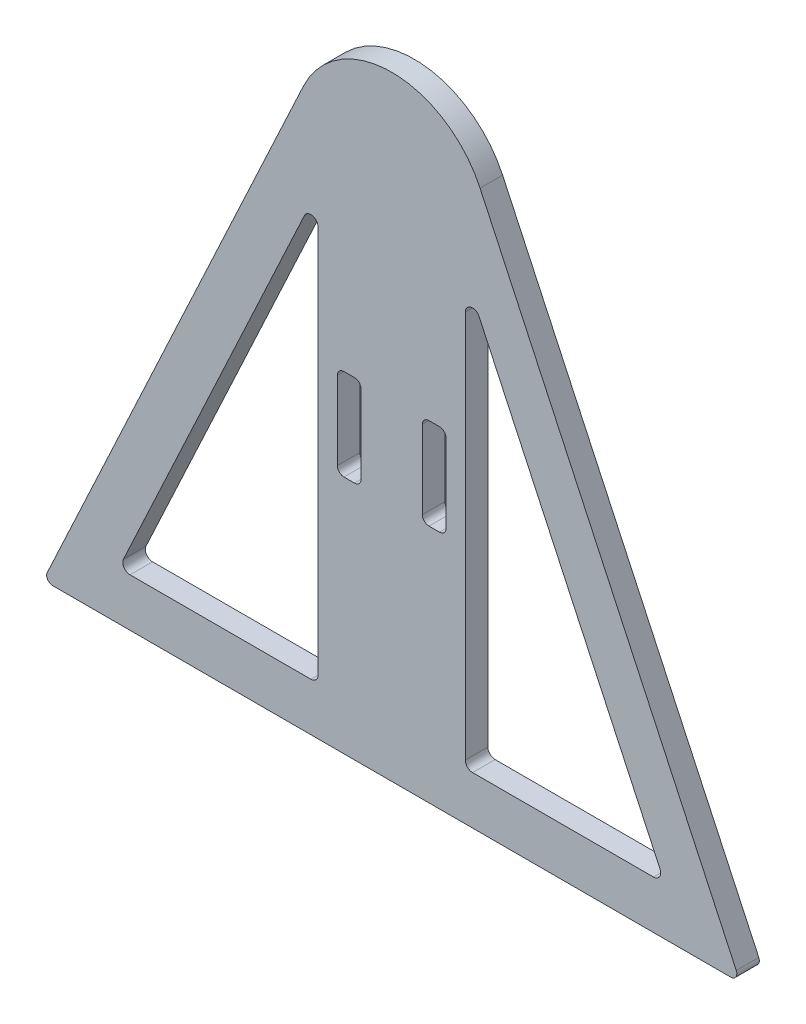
from build123d import *

# Parameters (mm, degrees)
EXTRUDE1_DEPTH     = 4.7625
CUT_EXTRUDE1_DEPTH = 150.337799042
FILLET1_R          = 1.27
CUT_EXTRUDE2_DEPTH = 149.982265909


with BuildPart() as part:
    # Sketch1 → Extrude1 (new body)
    with BuildSketch(Plane.XY):
        with BuildLine():
            Line((73.66, 0), (-73.66, 0))
            Line((-73.66, 0), (-18.670180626, 117.926048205))
            ThreePointArc((-18.670180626, 117.926048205), (0, 129.820265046), (18.670180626, 117.926048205))
            Line((18.670180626, 117.926048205), (73.66, 0))
        make_face()
    extrude(amount=EXTRUDE1_DEPTH)

    # Sketch2 → Cut-Extrude1 (cut, through all)
    with BuildSketch(Plane.XY.offset(4.7625)):
        with BuildLine():
            Line((-11.4935, 52.07), (-11.4935, 68.58))
            ThreePointArc((-11.4935, 68.58), (-11.084328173, 69.567828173), (-10.0965, 69.977))
            Line((-10.0965, 69.977), (-7.874, 69.977))
            ThreePointArc((-7.874, 69.977), (-6.886171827, 69.567828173), (-6.477, 68.58))
            Line((-6.477, 68.58), (-6.477, 52.07))
            ThreePointArc((-6.477, 52.07), (-6.886171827, 51.082171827), (-7.874, 50.673))
            Line((-7.874, 50.673), (-10.0965, 50.673))
            ThreePointArc((-10.0965, 50.673), (-11.084328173, 51.082171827), (-11.4935, 52.07))
        make_face()
        with BuildLine():
            Line((6.477, 68.58), (6.477, 52.07))
            ThreePointArc((6.477, 52.07), (6.886171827, 51.082171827), (7.874, 50.673))
            Line((7.874, 50.673), (10.0965, 50.673))
            ThreePointArc((10.0965, 50.673), (11.084328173, 51.082171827), (11.4935, 52.07))
            Line((11.4935, 52.07), (11.4935, 68.58))
            ThreePointArc((11.4935, 68.58), (11.084328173, 69.567828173), (10.0965, 69.977))
            Line((10.0965, 69.977), (7.874, 69.977))
            ThreePointArc((7.874, 69.977), (6.886171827, 69.567828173), (6.477, 68.58))
        make_face()
    extrude(amount=-CUT_EXTRUDE1_DEPTH, mode=Mode.SUBTRACT)

    # Fillet1
    fillet1_edges = [part.edges().sort_by_distance(p)[0] for p in [
        (73.66, 0, 2.38125),
        (-73.66, 0, 2.38125),
    ]]
    fillet(fillet1_edges, radius=FILLET1_R)

    # Sketch3 → Cut-Extrude2 (cut, through all)
    with BuildSketch(Plane.XY.offset(4.7625)):
        with BuildLine():
            Line((15.5575, 93.686285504), (15.5575, 11.684))
            ThreePointArc((15.5575, 11.684), (16.003869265, 10.606369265), (17.0815, 10.16))
            Line((17.0815, 10.16), (55.319793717, 10.16))
            ThreePointArc((55.319793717, 10.16), (56.60512228, 10.865155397), (56.701006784, 12.328070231))
            Line((56.701006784, 12.328070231), (18.462713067, 94.330355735))
            ThreePointArc((18.462713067, 94.330355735), (16.751646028, 95.174160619), (15.5575, 93.686285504))
        make_face()
        with BuildLine():
            Line((-56.701006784, 12.328070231), (-18.462713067, 94.330355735))
            ThreePointArc((-18.462713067, 94.330355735), (-16.751646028, 95.174160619), (-15.5575, 93.686285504))
            Line((-15.5575, 93.686285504), (-15.5575, 11.684))
            ThreePointArc((-15.5575, 11.684), (-16.003869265, 10.606369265), (-17.0815, 10.16))
            Line((-17.0815, 10.16), (-55.319793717, 10.16))
            ThreePointArc((-55.319793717, 10.16), (-56.60512228, 10.865155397), (-56.701006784, 12.328070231))
        make_face()
    extrude(amount=-CUT_EXTRUDE2_DEPTH, mode=Mode.SUBTRACT)


solid = part.part
